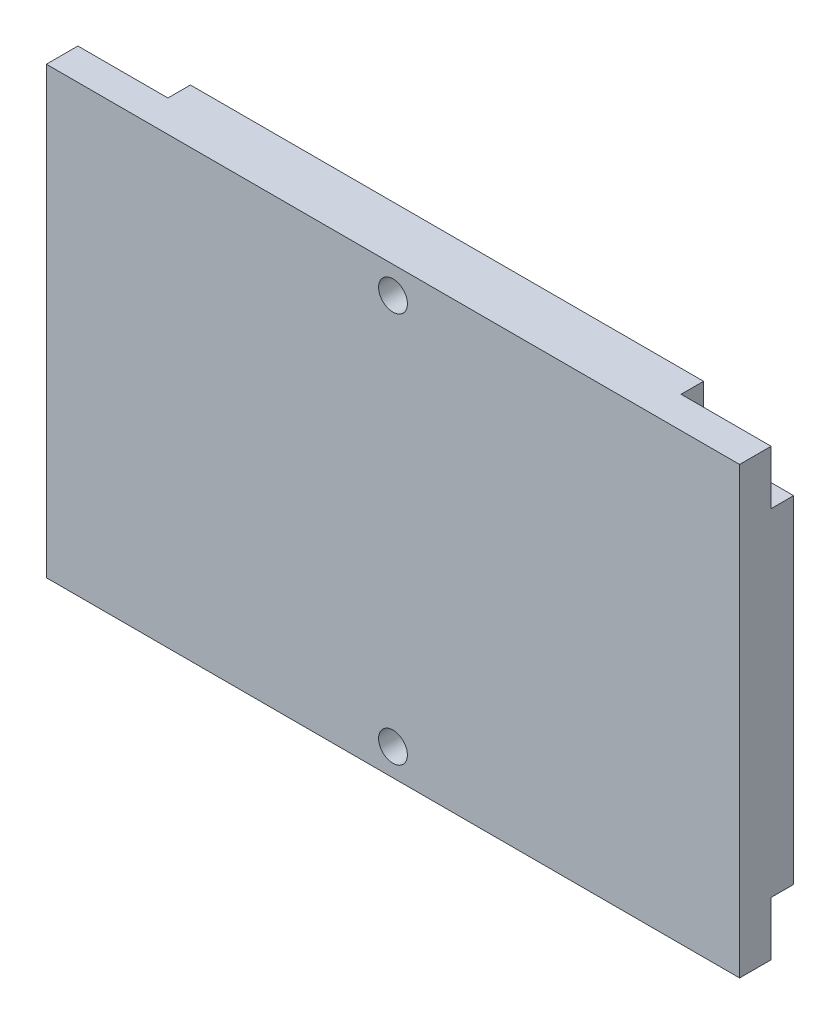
ISO-10303-21;
HEADER;
FILE_DESCRIPTION(('STEP AP214'),'2;1');
FILE_NAME('part.step','',(''),(''),'','','');
FILE_SCHEMA(('AUTOMOTIVE_DESIGN { 1 0 10303 214 1 1 1 1 }'));
ENDSEC;
DATA;
#1=APPLICATION_CONTEXT('core data for automotive mechanical design processes');
#2=APPLICATION_PROTOCOL_DEFINITION('international standard','automotive_design',2000,#1);
#3=PRODUCT_CONTEXT('',#1,'mechanical');
#4=PRODUCT('Part','Part','',(#3));
#5=PRODUCT_RELATED_PRODUCT_CATEGORY('part','',(#4));
#6=PRODUCT_DEFINITION_FORMATION('','',#4);
#7=PRODUCT_DEFINITION_CONTEXT('part definition',#1,'design');
#8=PRODUCT_DEFINITION('design','',#6,#7);
#9=PRODUCT_DEFINITION_SHAPE('','',#8);
#10=(LENGTH_UNIT() NAMED_UNIT(*) SI_UNIT(.MILLI.,.METRE.));
#11=(NAMED_UNIT(*) PLANE_ANGLE_UNIT() SI_UNIT($,.RADIAN.));
#12=(NAMED_UNIT(*) SI_UNIT($,.STERADIAN.) SOLID_ANGLE_UNIT());
#13=UNCERTAINTY_MEASURE_WITH_UNIT(LENGTH_MEASURE(1.E-05),#10,'distance_accuracy_value','');
#14=(GEOMETRIC_REPRESENTATION_CONTEXT(3) GLOBAL_UNCERTAINTY_ASSIGNED_CONTEXT((#13)) GLOBAL_UNIT_ASSIGNED_CONTEXT((#10,
#11,#12)) REPRESENTATION_CONTEXT('',''));
#15=CARTESIAN_POINT('',(0.,0.,0.));
#16=DIRECTION('',(0.,0.,1.));
#17=DIRECTION('',(1.,0.,0.));
#18=AXIS2_PLACEMENT_3D('',#15,#16,#17);
#19=CARTESIAN_POINT('',(38.5,18.7,6.00000000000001));
#20=DIRECTION('',(0.,-1.,0.));
#21=DIRECTION('',(1.,0.,0.));
#22=AXIS2_PLACEMENT_3D('',#19,#20,#21);
#23=PLANE('',#22);
#24=DIRECTION('',(-1.,0.,0.));
#25=VECTOR('',#24,1.);
#26=CARTESIAN_POINT('',(38.5,18.7,2.5));
#27=LINE('',#26,#25);
#28=CARTESIAN_POINT('',(38.5,18.7,2.5));
#29=VERTEX_POINT('',#28);
#30=CARTESIAN_POINT('',(30.7618950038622,18.7,2.5));
#31=VERTEX_POINT('',#30);
#32=EDGE_CURVE('E217',#29,#31,#27,.T.);
#33=ORIENTED_EDGE('',*,*,#32,.F.);
#34=DIRECTION('',(0.,0.,-1.));
#35=VECTOR('',#34,1.);
#36=CARTESIAN_POINT('',(38.5,18.7,6.00000000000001));
#37=LINE('',#36,#35);
#38=CARTESIAN_POINT('',(38.5,18.7,0.));
#39=VERTEX_POINT('',#38);
#40=EDGE_CURVE('E319',#29,#39,#37,.T.);
#41=ORIENTED_EDGE('',*,*,#40,.T.);
#42=DIRECTION('',(-1.,0.,0.));
#43=VECTOR('',#42,1.);
#44=CARTESIAN_POINT('',(38.5,18.7,0.));
#45=LINE('',#44,#43);
#46=CARTESIAN_POINT('',(30.7618950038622,18.7,0.));
#47=VERTEX_POINT('',#46);
#48=EDGE_CURVE('E294',#39,#47,#45,.T.);
#49=ORIENTED_EDGE('',*,*,#48,.T.);
#50=DIRECTION('',(0.,0.,-1.));
#51=VECTOR('',#50,1.);
#52=CARTESIAN_POINT('',(30.7618950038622,18.7,6.00000000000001));
#53=LINE('',#52,#51);
#54=EDGE_CURVE('E317',#31,#47,#53,.T.);
#55=ORIENTED_EDGE('',*,*,#54,.F.);
#56=EDGE_LOOP('',(#33,#41,#49,#55));
#57=FACE_BOUND('',#56,.T.);
#58=ADVANCED_FACE('F36',(#57),#23,.F.);
#59=CARTESIAN_POINT('',(29.6,19.8,6.00000000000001));
#60=DIRECTION('',(0.,0.,-1.));
#61=DIRECTION('',(-1.,0.,0.));
#62=AXIS2_PLACEMENT_3D('',#59,#60,#61);
#63=CYLINDRICAL_SURFACE('',#62,1.60000000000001);
#64=CARTESIAN_POINT('',(29.6,19.8,2.5));
#65=DIRECTION('',(0.,0.,1.));
#66=DIRECTION('',(1.,0.,0.));
#67=AXIS2_PLACEMENT_3D('',#64,#65,#66);
#68=CIRCLE('',#67,1.60000000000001);
#69=CARTESIAN_POINT('',(28.5,20.9618950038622,2.5));
#70=VERTEX_POINT('',#69);
#71=EDGE_CURVE('E215',#31,#70,#68,.F.);
#72=ORIENTED_EDGE('',*,*,#71,.F.);
#73=ORIENTED_EDGE('',*,*,#54,.T.);
#74=CARTESIAN_POINT('',(29.6,19.8,0.));
#75=DIRECTION('',(0.,0.,-1.));
#76=DIRECTION('',(-1.,0.,0.));
#77=AXIS2_PLACEMENT_3D('',#74,#75,#76);
#78=CIRCLE('',#77,1.60000000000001);
#79=CARTESIAN_POINT('',(28.5,20.9618950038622,0.));
#80=VERTEX_POINT('',#79);
#81=EDGE_CURVE('E297',#47,#80,#78,.T.);
#82=ORIENTED_EDGE('',*,*,#81,.T.);
#83=DIRECTION('',(0.,0.,-1.));
#84=VECTOR('',#83,1.);
#85=CARTESIAN_POINT('',(28.5,20.9618950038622,6.00000000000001));
#86=LINE('',#85,#84);
#87=EDGE_CURVE('E315',#70,#80,#86,.T.);
#88=ORIENTED_EDGE('',*,*,#87,.F.);
#89=EDGE_LOOP('',(#72,#73,#82,#88));
#90=FACE_BOUND('',#89,.T.);
#91=ADVANCED_FACE('F358',(#90),#63,.F.);
#92=CARTESIAN_POINT('',(28.5,24.7,6.00000000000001));
#93=DIRECTION('',(-1.,0.,0.));
#94=DIRECTION('',(0.,0.,1.));
#95=AXIS2_PLACEMENT_3D('',#92,#93,#94);
#96=PLANE('',#95);
#97=DIRECTION('',(0.,1.,0.));
#98=VECTOR('',#97,1.);
#99=CARTESIAN_POINT('',(28.5,24.7,2.5));
#100=LINE('',#99,#98);
#101=CARTESIAN_POINT('',(28.5,24.7,2.5));
#102=VERTEX_POINT('',#101);
#103=EDGE_CURVE('E213',#70,#102,#100,.T.);
#104=ORIENTED_EDGE('',*,*,#103,.F.);
#105=ORIENTED_EDGE('',*,*,#87,.T.);
#106=DIRECTION('',(0.,1.,0.));
#107=VECTOR('',#106,1.);
#108=CARTESIAN_POINT('',(28.5,24.7,0.));
#109=LINE('',#108,#107);
#110=CARTESIAN_POINT('',(28.5,24.7,0.));
#111=VERTEX_POINT('',#110);
#112=EDGE_CURVE('E300',#80,#111,#109,.T.);
#113=ORIENTED_EDGE('',*,*,#112,.T.);
#114=DIRECTION('',(0.,0.,-1.));
#115=VECTOR('',#114,1.);
#116=CARTESIAN_POINT('',(28.5,24.7,6.00000000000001));
#117=LINE('',#116,#115);
#118=EDGE_CURVE('E313',#102,#111,#117,.T.);
#119=ORIENTED_EDGE('',*,*,#118,.F.);
#120=EDGE_LOOP('',(#104,#105,#113,#119));
#121=FACE_BOUND('',#120,.T.);
#122=ADVANCED_FACE('F364',(#121),#96,.F.);
#123=CARTESIAN_POINT('',(-38.5,-18.7,6.00000000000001));
#124=DIRECTION('',(0.,1.,0.));
#125=DIRECTION('',(-1.,0.,0.));
#126=AXIS2_PLACEMENT_3D('',#123,#124,#125);
#127=PLANE('',#126);
#128=DIRECTION('',(1.,0.,0.));
#129=VECTOR('',#128,1.);
#130=CARTESIAN_POINT('',(-38.5,-18.7,2.5));
#131=LINE('',#130,#129);
#132=CARTESIAN_POINT('',(-38.5,-18.7,2.5));
#133=VERTEX_POINT('',#132);
#134=CARTESIAN_POINT('',(-30.7618950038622,-18.7,2.5));
#135=VERTEX_POINT('',#134);
#136=EDGE_CURVE('E231',#133,#135,#131,.T.);
#137=ORIENTED_EDGE('',*,*,#136,.F.);
#138=DIRECTION('',(0.,0.,-1.));
#139=VECTOR('',#138,1.);
#140=CARTESIAN_POINT('',(-38.5,-18.7,6.00000000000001));
#141=LINE('',#140,#139);
#142=CARTESIAN_POINT('',(-38.5,-18.7,0.));
#143=VERTEX_POINT('',#142);
#144=EDGE_CURVE('E334',#133,#143,#141,.T.);
#145=ORIENTED_EDGE('',*,*,#144,.T.);
#146=DIRECTION('',(1.,0.,0.));
#147=VECTOR('',#146,1.);
#148=CARTESIAN_POINT('',(-38.5,-18.7,0.));
#149=LINE('',#148,#147);
#150=CARTESIAN_POINT('',(-30.7618950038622,-18.7,0.));
#151=VERTEX_POINT('',#150);
#152=EDGE_CURVE('E271',#143,#151,#149,.T.);
#153=ORIENTED_EDGE('',*,*,#152,.T.);
#154=DIRECTION('',(0.,0.,-1.));
#155=VECTOR('',#154,1.);
#156=CARTESIAN_POINT('',(-30.7618950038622,-18.7,6.00000000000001));
#157=LINE('',#156,#155);
#158=EDGE_CURVE('E332',#135,#151,#157,.T.);
#159=ORIENTED_EDGE('',*,*,#158,.F.);
#160=EDGE_LOOP('',(#137,#145,#153,#159));
#161=FACE_BOUND('',#160,.T.);
#162=ADVANCED_FACE('F394',(#161),#127,.F.);
#163=CARTESIAN_POINT('',(-29.6,-19.8,6.00000000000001));
#164=DIRECTION('',(0.,0.,-1.));
#165=DIRECTION('',(-1.,0.,0.));
#166=AXIS2_PLACEMENT_3D('',#163,#164,#165);
#167=CYLINDRICAL_SURFACE('',#166,1.60000000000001);
#168=CARTESIAN_POINT('',(-29.6,-19.8,2.5));
#169=DIRECTION('',(0.,0.,1.));
#170=DIRECTION('',(1.,0.,0.));
#171=AXIS2_PLACEMENT_3D('',#168,#169,#170);
#172=CIRCLE('',#171,1.60000000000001);
#173=CARTESIAN_POINT('',(-28.5,-20.9618950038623,2.5));
#174=VERTEX_POINT('',#173);
#175=EDGE_CURVE('E229',#135,#174,#172,.F.);
#176=ORIENTED_EDGE('',*,*,#175,.F.);
#177=ORIENTED_EDGE('',*,*,#158,.T.);
#178=CARTESIAN_POINT('',(-29.6,-19.8,0.));
#179=DIRECTION('',(0.,0.,-1.));
#180=DIRECTION('',(-1.,0.,0.));
#181=AXIS2_PLACEMENT_3D('',#178,#179,#180);
#182=CIRCLE('',#181,1.60000000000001);
#183=CARTESIAN_POINT('',(-28.5,-20.9618950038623,0.));
#184=VERTEX_POINT('',#183);
#185=EDGE_CURVE('E274',#151,#184,#182,.T.);
#186=ORIENTED_EDGE('',*,*,#185,.T.);
#187=DIRECTION('',(0.,0.,-1.));
#188=VECTOR('',#187,1.);
#189=CARTESIAN_POINT('',(-28.5,-20.9618950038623,6.00000000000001));
#190=LINE('',#189,#188);
#191=EDGE_CURVE('E330',#174,#184,#190,.T.);
#192=ORIENTED_EDGE('',*,*,#191,.F.);
#193=EDGE_LOOP('',(#176,#177,#186,#192));
#194=FACE_BOUND('',#193,.T.);
#195=ADVANCED_FACE('F390',(#194),#167,.F.);
#196=CARTESIAN_POINT('',(-28.5,-20.9618950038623,6.00000000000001));
#197=DIRECTION('',(1.,0.,0.));
#198=DIRECTION('',(0.,0.,-1.));
#199=AXIS2_PLACEMENT_3D('',#196,#197,#198);
#200=PLANE('',#199);
#201=DIRECTION('',(0.,-1.,0.));
#202=VECTOR('',#201,1.);
#203=CARTESIAN_POINT('',(-28.5,-20.9618950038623,2.5));
#204=LINE('',#203,#202);
#205=CARTESIAN_POINT('',(-28.5,-24.7,2.5));
#206=VERTEX_POINT('',#205);
#207=EDGE_CURVE('E227',#174,#206,#204,.T.);
#208=ORIENTED_EDGE('',*,*,#207,.F.);
#209=ORIENTED_EDGE('',*,*,#191,.T.);
#210=DIRECTION('',(0.,-1.,0.));
#211=VECTOR('',#210,1.);
#212=CARTESIAN_POINT('',(-28.5,-20.9618950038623,0.));
#213=LINE('',#212,#211);
#214=CARTESIAN_POINT('',(-28.5,-24.7,0.));
#215=VERTEX_POINT('',#214);
#216=EDGE_CURVE('E277',#184,#215,#213,.T.);
#217=ORIENTED_EDGE('',*,*,#216,.T.);
#218=DIRECTION('',(0.,0.,-1.));
#219=VECTOR('',#218,1.);
#220=CARTESIAN_POINT('',(-28.5,-24.7,6.00000000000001));
#221=LINE('',#220,#219);
#222=EDGE_CURVE('E328',#206,#215,#221,.T.);
#223=ORIENTED_EDGE('',*,*,#222,.F.);
#224=EDGE_LOOP('',(#208,#209,#217,#223));
#225=FACE_BOUND('',#224,.T.);
#226=ADVANCED_FACE('F387',(#225),#200,.F.);
#227=CARTESIAN_POINT('',(-29.6,19.8,6.00000000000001));
#228=DIRECTION('',(0.,0.,1.));
#229=DIRECTION('',(1.,0.,0.));
#230=AXIS2_PLACEMENT_3D('',#227,#228,#229);
#231=PLANE('',#230);
#232=DIRECTION('',(1.,0.,0.));
#233=VECTOR('',#232,1.);
#234=CARTESIAN_POINT('',(-28.5,-24.7,6.00000000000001));
#235=LINE('',#234,#233);
#236=CARTESIAN_POINT('',(-38.5,-24.7,6.00000000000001));
#237=VERTEX_POINT('',#236);
#238=CARTESIAN_POINT('',(38.5,-24.7,6.00000000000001));
#239=VERTEX_POINT('',#238);
#240=EDGE_CURVE('E261',#237,#239,#235,.T.);
#241=ORIENTED_EDGE('',*,*,#240,.T.);
#242=DIRECTION('',(0.,1.,0.));
#243=VECTOR('',#242,1.);
#244=CARTESIAN_POINT('',(38.5,18.7,6.00000000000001));
#245=LINE('',#244,#243);
#246=CARTESIAN_POINT('',(38.5,24.7,6.00000000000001));
#247=VERTEX_POINT('',#246);
#248=EDGE_CURVE('E193',#239,#247,#245,.T.);
#249=ORIENTED_EDGE('',*,*,#248,.T.);
#250=DIRECTION('',(-1.,0.,0.));
#251=VECTOR('',#250,1.);
#252=CARTESIAN_POINT('',(-28.5,24.7,6.00000000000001));
#253=LINE('',#252,#251);
#254=CARTESIAN_POINT('',(-38.5,24.7,6.00000000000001));
#255=VERTEX_POINT('',#254);
#256=EDGE_CURVE('E265',#247,#255,#253,.T.);
#257=ORIENTED_EDGE('',*,*,#256,.T.);
#258=DIRECTION('',(0.,-1.,0.));
#259=VECTOR('',#258,1.);
#260=CARTESIAN_POINT('',(-38.5,18.7,6.00000000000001));
#261=LINE('',#260,#259);
#262=EDGE_CURVE('E259',#255,#237,#261,.T.);
#263=ORIENTED_EDGE('',*,*,#262,.T.);
#264=EDGE_LOOP('',(#241,#249,#257,#263));
#265=FACE_BOUND('',#264,.T.);
#266=CARTESIAN_POINT('',(0.,21.7,6.00000000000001));
#267=DIRECTION('',(0.,0.,1.));
#268=DIRECTION('',(1.,0.,0.));
#269=AXIS2_PLACEMENT_3D('',#266,#267,#268);
#270=CIRCLE('',#269,1.6);
#271=CARTESIAN_POINT('',(1.6,21.7,6.00000000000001));
#272=VERTEX_POINT('',#271);
#273=EDGE_CURVE('E253',#272,#272,#270,.T.);
#274=ORIENTED_EDGE('',*,*,#273,.F.);
#275=EDGE_LOOP('',(#274));
#276=FACE_BOUND('',#275,.T.);
#277=CARTESIAN_POINT('',(0.,-21.7,6.00000000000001));
#278=DIRECTION('',(0.,0.,1.));
#279=DIRECTION('',(-1.,0.,0.));
#280=AXIS2_PLACEMENT_3D('',#277,#278,#279);
#281=CIRCLE('',#280,1.6);
#282=CARTESIAN_POINT('',(-1.6,-21.7,6.00000000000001));
#283=VERTEX_POINT('',#282);
#284=EDGE_CURVE('E247',#283,#283,#281,.T.);
#285=ORIENTED_EDGE('',*,*,#284,.F.);
#286=EDGE_LOOP('',(#285));
#287=FACE_BOUND('',#286,.T.);
#288=ADVANCED_FACE('F354',(#265,#276,#287),#231,.T.);
#289=CARTESIAN_POINT('',(-29.6,19.8,0.));
#290=DIRECTION('',(0.,0.,1.));
#291=DIRECTION('',(1.,0.,0.));
#292=AXIS2_PLACEMENT_3D('',#289,#290,#291);
#293=PLANE('',#292);
#294=CARTESIAN_POINT('',(0.,21.7,0.));
#295=DIRECTION('',(0.,0.,1.));
#296=DIRECTION('',(1.,0.,0.));
#297=AXIS2_PLACEMENT_3D('',#294,#295,#296);
#298=CIRCLE('',#297,1.6);
#299=CARTESIAN_POINT('',(1.6,21.7,0.));
#300=VERTEX_POINT('',#299);
#301=EDGE_CURVE('E250',#300,#300,#298,.T.);
#302=ORIENTED_EDGE('',*,*,#301,.T.);
#303=EDGE_LOOP('',(#302));
#304=FACE_BOUND('',#303,.T.);
#305=DIRECTION('',(-1.,0.,0.));
#306=VECTOR('',#305,1.);
#307=CARTESIAN_POINT('',(-38.5,18.7,0.));
#308=LINE('',#307,#306);
#309=CARTESIAN_POINT('',(-30.7618950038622,18.7,0.));
#310=VERTEX_POINT('',#309);
#311=CARTESIAN_POINT('',(-38.5,18.7,0.));
#312=VERTEX_POINT('',#311);
#313=EDGE_CURVE('E256',#310,#312,#308,.T.);
#314=ORIENTED_EDGE('',*,*,#313,.F.);
#315=CARTESIAN_POINT('',(-29.6,19.8,0.));
#316=DIRECTION('',(0.,0.,-1.));
#317=DIRECTION('',(1.,0.,0.));
#318=AXIS2_PLACEMENT_3D('',#315,#316,#317);
#319=CIRCLE('',#318,1.60000000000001);
#320=CARTESIAN_POINT('',(-28.5,20.9618950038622,0.));
#321=VERTEX_POINT('',#320);
#322=EDGE_CURVE('E262',#321,#310,#319,.T.);
#323=ORIENTED_EDGE('',*,*,#322,.F.);
#324=DIRECTION('',(0.,-1.,0.));
#325=VECTOR('',#324,1.);
#326=CARTESIAN_POINT('',(-28.5,20.9618950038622,0.));
#327=LINE('',#326,#325);
#328=CARTESIAN_POINT('',(-28.5,24.7,0.));
#329=VERTEX_POINT('',#328);
#330=EDGE_CURVE('E306',#329,#321,#327,.T.);
#331=ORIENTED_EDGE('',*,*,#330,.F.);
#332=DIRECTION('',(-1.,0.,0.));
#333=VECTOR('',#332,1.);
#334=CARTESIAN_POINT('',(-28.5,24.7,0.));
#335=LINE('',#334,#333);
#336=EDGE_CURVE('E303',#111,#329,#335,.T.);
#337=ORIENTED_EDGE('',*,*,#336,.F.);
#338=ORIENTED_EDGE('',*,*,#112,.F.);
#339=ORIENTED_EDGE('',*,*,#81,.F.);
#340=ORIENTED_EDGE('',*,*,#48,.F.);
#341=DIRECTION('',(0.,1.,0.));
#342=VECTOR('',#341,1.);
#343=CARTESIAN_POINT('',(38.5,18.7,0.));
#344=LINE('',#343,#342);
#345=CARTESIAN_POINT('',(38.5,-18.7,0.));
#346=VERTEX_POINT('',#345);
#347=EDGE_CURVE('E291',#346,#39,#344,.T.);
#348=ORIENTED_EDGE('',*,*,#347,.F.);
#349=DIRECTION('',(1.,0.,0.));
#350=VECTOR('',#349,1.);
#351=CARTESIAN_POINT('',(38.5,-18.7,0.));
#352=LINE('',#351,#350);
#353=CARTESIAN_POINT('',(30.7618950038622,-18.7,0.));
#354=VERTEX_POINT('',#353);
#355=EDGE_CURVE('E288',#354,#346,#352,.T.);
#356=ORIENTED_EDGE('',*,*,#355,.F.);
#357=CARTESIAN_POINT('',(29.6,-19.8,0.));
#358=DIRECTION('',(0.,0.,-1.));
#359=DIRECTION('',(1.,0.,0.));
#360=AXIS2_PLACEMENT_3D('',#357,#358,#359);
#361=CIRCLE('',#360,1.60000000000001);
#362=CARTESIAN_POINT('',(28.5,-20.9618950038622,0.));
#363=VERTEX_POINT('',#362);
#364=EDGE_CURVE('E285',#363,#354,#361,.T.);
#365=ORIENTED_EDGE('',*,*,#364,.F.);
#366=DIRECTION('',(0.,1.,0.));
#367=VECTOR('',#366,1.);
#368=CARTESIAN_POINT('',(28.5,-20.9618950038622,0.));
#369=LINE('',#368,#367);
#370=CARTESIAN_POINT('',(28.5,-24.7,0.));
#371=VERTEX_POINT('',#370);
#372=EDGE_CURVE('E282',#371,#363,#369,.T.);
#373=ORIENTED_EDGE('',*,*,#372,.F.);
#374=DIRECTION('',(1.,0.,0.));
#375=VECTOR('',#374,1.);
#376=CARTESIAN_POINT('',(-28.5,-24.7,0.));
#377=LINE('',#376,#375);
#378=EDGE_CURVE('E280',#215,#371,#377,.T.);
#379=ORIENTED_EDGE('',*,*,#378,.F.);
#380=ORIENTED_EDGE('',*,*,#216,.F.);
#381=ORIENTED_EDGE('',*,*,#185,.F.);
#382=ORIENTED_EDGE('',*,*,#152,.F.);
#383=DIRECTION('',(0.,-1.,0.));
#384=VECTOR('',#383,1.);
#385=CARTESIAN_POINT('',(-38.5,18.7,0.));
#386=LINE('',#385,#384);
#387=EDGE_CURVE('E268',#312,#143,#386,.T.);
#388=ORIENTED_EDGE('',*,*,#387,.F.);
#389=EDGE_LOOP('',(#314,#323,#331,#337,#338,#339,#340,#348,#356,#365,#373,#379,#380,#381,#382,#388));
#390=FACE_BOUND('',#389,.T.);
#391=CARTESIAN_POINT('',(0.,-21.7,0.));
#392=DIRECTION('',(0.,0.,1.));
#393=DIRECTION('',(-1.,0.,0.));
#394=AXIS2_PLACEMENT_3D('',#391,#392,#393);
#395=CIRCLE('',#394,1.6);
#396=CARTESIAN_POINT('',(-1.6,-21.7,0.));
#397=VERTEX_POINT('',#396);
#398=EDGE_CURVE('E246',#397,#397,#395,.T.);
#399=ORIENTED_EDGE('',*,*,#398,.T.);
#400=EDGE_LOOP('',(#399));
#401=FACE_BOUND('',#400,.T.);
#402=ADVANCED_FACE('F345',(#304,#390,#401),#293,.F.);
#403=CARTESIAN_POINT('',(-38.5,18.7,6.00000000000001));
#404=DIRECTION('',(0.,-1.,0.));
#405=DIRECTION('',(1.,0.,0.));
#406=AXIS2_PLACEMENT_3D('',#403,#404,#405);
#407=PLANE('',#406);
#408=DIRECTION('',(0.,0.,-1.));
#409=VECTOR('',#408,1.);
#410=CARTESIAN_POINT('',(-38.5,18.7,6.00000000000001));
#411=LINE('',#410,#409);
#412=CARTESIAN_POINT('',(-38.5,18.7,2.5));
#413=VERTEX_POINT('',#412);
#414=EDGE_CURVE('E44',#413,#312,#411,.T.);
#415=ORIENTED_EDGE('',*,*,#414,.F.);
#416=DIRECTION('',(1.,0.,0.));
#417=VECTOR('',#416,1.);
#418=CARTESIAN_POINT('',(-38.5,18.7,2.5));
#419=LINE('',#418,#417);
#420=CARTESIAN_POINT('',(-30.7618950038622,18.7,2.5));
#421=VERTEX_POINT('',#420);
#422=EDGE_CURVE('E244',#413,#421,#419,.T.);
#423=ORIENTED_EDGE('',*,*,#422,.T.);
#424=DIRECTION('',(0.,0.,-1.));
#425=VECTOR('',#424,1.);
#426=CARTESIAN_POINT('',(-30.7618950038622,18.7,6.00000000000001));
#427=LINE('',#426,#425);
#428=EDGE_CURVE('E51',#421,#310,#427,.T.);
#429=ORIENTED_EDGE('',*,*,#428,.T.);
#430=ORIENTED_EDGE('',*,*,#313,.T.);
#431=EDGE_LOOP('',(#415,#423,#429,#430));
#432=FACE_BOUND('',#431,.T.);
#433=ADVANCED_FACE('F38',(#432),#407,.F.);
#434=CARTESIAN_POINT('',(-38.5,18.7,6.00000000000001));
#435=DIRECTION('',(1.,0.,0.));
#436=DIRECTION('',(0.,1.,0.));
#437=AXIS2_PLACEMENT_3D('',#434,#435,#436);
#438=PLANE('',#437);
#439=DIRECTION('',(0.,0.,1.));
#440=VECTOR('',#439,1.);
#441=CARTESIAN_POINT('',(-38.5,-24.7,2.5));
#442=LINE('',#441,#440);
#443=CARTESIAN_POINT('',(-38.5,-24.7,2.5));
#444=VERTEX_POINT('',#443);
#445=EDGE_CURVE('E224',#444,#237,#442,.T.);
#446=ORIENTED_EDGE('',*,*,#445,.T.);
#447=ORIENTED_EDGE('',*,*,#262,.F.);
#448=DIRECTION('',(0.,0.,1.));
#449=VECTOR('',#448,1.);
#450=CARTESIAN_POINT('',(-38.5,24.7,2.5));
#451=LINE('',#450,#449);
#452=CARTESIAN_POINT('',(-38.5,24.7,2.5));
#453=VERTEX_POINT('',#452);
#454=EDGE_CURVE('E238',#453,#255,#451,.T.);
#455=ORIENTED_EDGE('',*,*,#454,.F.);
#456=DIRECTION('',(0.,-1.,0.));
#457=VECTOR('',#456,1.);
#458=CARTESIAN_POINT('',(-38.5,24.7,2.5));
#459=LINE('',#458,#457);
#460=EDGE_CURVE('E235',#453,#413,#459,.T.);
#461=ORIENTED_EDGE('',*,*,#460,.T.);
#462=ORIENTED_EDGE('',*,*,#414,.T.);
#463=ORIENTED_EDGE('',*,*,#387,.T.);
#464=ORIENTED_EDGE('',*,*,#144,.F.);
#465=DIRECTION('',(0.,-1.,0.));
#466=VECTOR('',#465,1.);
#467=CARTESIAN_POINT('',(-38.5,-13.6713499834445,2.5));
#468=LINE('',#467,#466);
#469=EDGE_CURVE('E219',#133,#444,#468,.T.);
#470=ORIENTED_EDGE('',*,*,#469,.T.);
#471=EDGE_LOOP('',(#446,#447,#455,#461,#462,#463,#464,#470));
#472=FACE_BOUND('',#471,.T.);
#473=ADVANCED_FACE('F338',(#472),#438,.F.);
#474=CARTESIAN_POINT('',(-28.5,-24.7,6.00000000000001));
#475=DIRECTION('',(0.,1.,0.));
#476=DIRECTION('',(-1.,0.,0.));
#477=AXIS2_PLACEMENT_3D('',#474,#475,#476);
#478=PLANE('',#477);
#479=DIRECTION('',(0.,0.,1.));
#480=VECTOR('',#479,1.);
#481=CARTESIAN_POINT('',(38.5,-24.7,2.5));
#482=LINE('',#481,#480);
#483=CARTESIAN_POINT('',(38.5,-24.7,2.5));
#484=VERTEX_POINT('',#483);
#485=EDGE_CURVE('E179',#484,#239,#482,.T.);
#486=ORIENTED_EDGE('',*,*,#485,.T.);
#487=ORIENTED_EDGE('',*,*,#240,.F.);
#488=ORIENTED_EDGE('',*,*,#445,.F.);
#489=DIRECTION('',(1.,0.,0.));
#490=VECTOR('',#489,1.);
#491=CARTESIAN_POINT('',(-38.5,-24.7,2.5));
#492=LINE('',#491,#490);
#493=EDGE_CURVE('E221',#444,#206,#492,.T.);
#494=ORIENTED_EDGE('',*,*,#493,.T.);
#495=ORIENTED_EDGE('',*,*,#222,.T.);
#496=ORIENTED_EDGE('',*,*,#378,.T.);
#497=DIRECTION('',(0.,0.,-1.));
#498=VECTOR('',#497,1.);
#499=CARTESIAN_POINT('',(28.5,-24.7,6.00000000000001));
#500=LINE('',#499,#498);
#501=CARTESIAN_POINT('',(28.5,-24.7,2.5));
#502=VERTEX_POINT('',#501);
#503=EDGE_CURVE('E181',#502,#371,#500,.T.);
#504=ORIENTED_EDGE('',*,*,#503,.F.);
#505=DIRECTION('',(1.,0.,0.));
#506=VECTOR('',#505,1.);
#507=CARTESIAN_POINT('',(38.5,-24.7,2.5));
#508=LINE('',#507,#506);
#509=EDGE_CURVE('E175',#502,#484,#508,.T.);
#510=ORIENTED_EDGE('',*,*,#509,.T.);
#511=EDGE_LOOP('',(#486,#487,#488,#494,#495,#496,#504,#510));
#512=FACE_BOUND('',#511,.T.);
#513=ADVANCED_FACE('F177',(#512),#478,.F.);
#514=CARTESIAN_POINT('',(28.5,-20.9618950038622,6.00000000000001));
#515=DIRECTION('',(-1.,0.,0.));
#516=DIRECTION('',(0.,0.,1.));
#517=AXIS2_PLACEMENT_3D('',#514,#515,#516);
#518=PLANE('',#517);
#519=DIRECTION('',(0.,0.,-1.));
#520=VECTOR('',#519,1.);
#521=CARTESIAN_POINT('',(28.5,-20.9618950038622,6.00000000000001));
#522=LINE('',#521,#520);
#523=CARTESIAN_POINT('',(28.5,-20.9618950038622,2.5));
#524=VERTEX_POINT('',#523);
#525=EDGE_CURVE('E325',#524,#363,#522,.T.);
#526=ORIENTED_EDGE('',*,*,#525,.F.);
#527=DIRECTION('',(0.,-1.,0.));
#528=VECTOR('',#527,1.);
#529=CARTESIAN_POINT('',(28.5,-20.9618950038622,2.5));
#530=LINE('',#529,#528);
#531=EDGE_CURVE('E204',#524,#502,#530,.T.);
#532=ORIENTED_EDGE('',*,*,#531,.T.);
#533=ORIENTED_EDGE('',*,*,#503,.T.);
#534=ORIENTED_EDGE('',*,*,#372,.T.);
#535=EDGE_LOOP('',(#526,#532,#533,#534));
#536=FACE_BOUND('',#535,.T.);
#537=ADVANCED_FACE('F380',(#536),#518,.F.);
#538=CARTESIAN_POINT('',(29.6,-19.8,6.00000000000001));
#539=DIRECTION('',(0.,0.,-1.));
#540=DIRECTION('',(-1.,0.,0.));
#541=AXIS2_PLACEMENT_3D('',#538,#539,#540);
#542=CYLINDRICAL_SURFACE('',#541,1.60000000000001);
#543=DIRECTION('',(0.,0.,-1.));
#544=VECTOR('',#543,1.);
#545=CARTESIAN_POINT('',(30.7618950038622,-18.7,6.00000000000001));
#546=LINE('',#545,#544);
#547=CARTESIAN_POINT('',(30.7618950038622,-18.7,2.5));
#548=VERTEX_POINT('',#547);
#549=EDGE_CURVE('E323',#548,#354,#546,.T.);
#550=ORIENTED_EDGE('',*,*,#549,.F.);
#551=CARTESIAN_POINT('',(29.6,-19.8,2.5));
#552=DIRECTION('',(0.,0.,-1.));
#553=DIRECTION('',(-1.,0.,0.));
#554=AXIS2_PLACEMENT_3D('',#551,#552,#553);
#555=CIRCLE('',#554,1.60000000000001);
#556=EDGE_CURVE('E201',#548,#524,#555,.F.);
#557=ORIENTED_EDGE('',*,*,#556,.T.);
#558=ORIENTED_EDGE('',*,*,#525,.T.);
#559=ORIENTED_EDGE('',*,*,#364,.T.);
#560=EDGE_LOOP('',(#550,#557,#558,#559));
#561=FACE_BOUND('',#560,.T.);
#562=ADVANCED_FACE('F376',(#561),#542,.F.);
#563=CARTESIAN_POINT('',(38.5,-18.7,6.00000000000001));
#564=DIRECTION('',(0.,1.,0.));
#565=DIRECTION('',(-1.,0.,0.));
#566=AXIS2_PLACEMENT_3D('',#563,#564,#565);
#567=PLANE('',#566);
#568=DIRECTION('',(0.,0.,-1.));
#569=VECTOR('',#568,1.);
#570=CARTESIAN_POINT('',(38.5,-18.7,6.00000000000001));
#571=LINE('',#570,#569);
#572=CARTESIAN_POINT('',(38.5,-18.7,2.5));
#573=VERTEX_POINT('',#572);
#574=EDGE_CURVE('E321',#573,#346,#571,.T.);
#575=ORIENTED_EDGE('',*,*,#574,.F.);
#576=DIRECTION('',(-1.,0.,0.));
#577=VECTOR('',#576,1.);
#578=CARTESIAN_POINT('',(38.5,-18.7,2.5));
#579=LINE('',#578,#577);
#580=EDGE_CURVE('E194',#573,#548,#579,.T.);
#581=ORIENTED_EDGE('',*,*,#580,.T.);
#582=ORIENTED_EDGE('',*,*,#549,.T.);
#583=ORIENTED_EDGE('',*,*,#355,.T.);
#584=EDGE_LOOP('',(#575,#581,#582,#583));
#585=FACE_BOUND('',#584,.T.);
#586=ADVANCED_FACE('F373',(#585),#567,.F.);
#587=CARTESIAN_POINT('',(38.5,18.7,6.00000000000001));
#588=DIRECTION('',(-1.,0.,0.));
#589=DIRECTION('',(0.,0.,1.));
#590=AXIS2_PLACEMENT_3D('',#587,#588,#589);
#591=PLANE('',#590);
#592=DIRECTION('',(0.,0.,1.));
#593=VECTOR('',#592,1.);
#594=CARTESIAN_POINT('',(38.5,24.7,2.5));
#595=LINE('',#594,#593);
#596=CARTESIAN_POINT('',(38.5,24.7,2.5));
#597=VERTEX_POINT('',#596);
#598=EDGE_CURVE('E211',#597,#247,#595,.T.);
#599=ORIENTED_EDGE('',*,*,#598,.T.);
#600=ORIENTED_EDGE('',*,*,#248,.F.);
#601=ORIENTED_EDGE('',*,*,#485,.F.);
#602=DIRECTION('',(0.,1.,0.));
#603=VECTOR('',#602,1.);
#604=CARTESIAN_POINT('',(38.5,-8.96910221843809,2.5));
#605=LINE('',#604,#603);
#606=EDGE_CURVE('E185',#484,#573,#605,.T.);
#607=ORIENTED_EDGE('',*,*,#606,.T.);
#608=ORIENTED_EDGE('',*,*,#574,.T.);
#609=ORIENTED_EDGE('',*,*,#347,.T.);
#610=ORIENTED_EDGE('',*,*,#40,.F.);
#611=DIRECTION('',(0.,1.,0.));
#612=VECTOR('',#611,1.);
#613=CARTESIAN_POINT('',(38.5,24.7,2.5));
#614=LINE('',#613,#612);
#615=EDGE_CURVE('E206',#29,#597,#614,.T.);
#616=ORIENTED_EDGE('',*,*,#615,.T.);
#617=EDGE_LOOP('',(#599,#600,#601,#607,#608,#609,#610,#616));
#618=FACE_BOUND('',#617,.T.);
#619=ADVANCED_FACE('F191',(#618),#591,.F.);
#620=CARTESIAN_POINT('',(-28.5,24.7,6.00000000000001));
#621=DIRECTION('',(0.,-1.,0.));
#622=DIRECTION('',(1.,0.,0.));
#623=AXIS2_PLACEMENT_3D('',#620,#621,#622);
#624=PLANE('',#623);
#625=ORIENTED_EDGE('',*,*,#454,.T.);
#626=ORIENTED_EDGE('',*,*,#256,.F.);
#627=ORIENTED_EDGE('',*,*,#598,.F.);
#628=DIRECTION('',(-1.,0.,0.));
#629=VECTOR('',#628,1.);
#630=CARTESIAN_POINT('',(22.0744408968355,24.7,2.5));
#631=LINE('',#630,#629);
#632=EDGE_CURVE('E208',#597,#102,#631,.T.);
#633=ORIENTED_EDGE('',*,*,#632,.T.);
#634=ORIENTED_EDGE('',*,*,#118,.T.);
#635=ORIENTED_EDGE('',*,*,#336,.T.);
#636=DIRECTION('',(0.,0.,-1.));
#637=VECTOR('',#636,1.);
#638=CARTESIAN_POINT('',(-28.5,24.7,6.00000000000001));
#639=LINE('',#638,#637);
#640=CARTESIAN_POINT('',(-28.5,24.7,2.5));
#641=VERTEX_POINT('',#640);
#642=EDGE_CURVE('E311',#641,#329,#639,.T.);
#643=ORIENTED_EDGE('',*,*,#642,.F.);
#644=DIRECTION('',(-1.,0.,0.));
#645=VECTOR('',#644,1.);
#646=CARTESIAN_POINT('',(-25.2092727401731,24.7,2.5));
#647=LINE('',#646,#645);
#648=EDGE_CURVE('E233',#641,#453,#647,.T.);
#649=ORIENTED_EDGE('',*,*,#648,.T.);
#650=EDGE_LOOP('',(#625,#626,#627,#633,#634,#635,#643,#649));
#651=FACE_BOUND('',#650,.T.);
#652=ADVANCED_FACE('F372',(#651),#624,.F.);
#653=CARTESIAN_POINT('',(-28.5,20.9618950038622,6.00000000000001));
#654=DIRECTION('',(1.,0.,0.));
#655=DIRECTION('',(0.,0.,-1.));
#656=AXIS2_PLACEMENT_3D('',#653,#654,#655);
#657=PLANE('',#656);
#658=DIRECTION('',(0.,0.,-1.));
#659=VECTOR('',#658,1.);
#660=CARTESIAN_POINT('',(-28.5,20.9618950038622,6.00000000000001));
#661=LINE('',#660,#659);
#662=CARTESIAN_POINT('',(-28.5,20.9618950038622,2.5));
#663=VERTEX_POINT('',#662);
#664=EDGE_CURVE('E57',#663,#321,#661,.T.);
#665=ORIENTED_EDGE('',*,*,#664,.F.);
#666=DIRECTION('',(0.,1.,0.));
#667=VECTOR('',#666,1.);
#668=CARTESIAN_POINT('',(-28.5,20.9618950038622,2.5));
#669=LINE('',#668,#667);
#670=EDGE_CURVE('E241',#663,#641,#669,.T.);
#671=ORIENTED_EDGE('',*,*,#670,.T.);
#672=ORIENTED_EDGE('',*,*,#642,.T.);
#673=ORIENTED_EDGE('',*,*,#330,.T.);
#674=EDGE_LOOP('',(#665,#671,#672,#673));
#675=FACE_BOUND('',#674,.T.);
#676=ADVANCED_FACE('F444',(#675),#657,.F.);
#677=CARTESIAN_POINT('',(-29.6,19.8,6.00000000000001));
#678=DIRECTION('',(0.,0.,-1.));
#679=DIRECTION('',(-1.,0.,0.));
#680=AXIS2_PLACEMENT_3D('',#677,#678,#679);
#681=CYLINDRICAL_SURFACE('',#680,1.60000000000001);
#682=ORIENTED_EDGE('',*,*,#428,.F.);
#683=CARTESIAN_POINT('',(-29.6,19.8,2.5));
#684=DIRECTION('',(0.,0.,-1.));
#685=DIRECTION('',(-1.,0.,0.));
#686=AXIS2_PLACEMENT_3D('',#683,#684,#685);
#687=CIRCLE('',#686,1.60000000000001);
#688=EDGE_CURVE('E11',#421,#663,#687,.F.);
#689=ORIENTED_EDGE('',*,*,#688,.T.);
#690=ORIENTED_EDGE('',*,*,#664,.T.);
#691=ORIENTED_EDGE('',*,*,#322,.T.);
#692=EDGE_LOOP('',(#682,#689,#690,#691));
#693=FACE_BOUND('',#692,.T.);
#694=ADVANCED_FACE('F441',(#693),#681,.F.);
#695=CARTESIAN_POINT('',(0.,21.7,6.00000000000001));
#696=DIRECTION('',(0.,0.,-1.));
#697=DIRECTION('',(-1.,0.,0.));
#698=AXIS2_PLACEMENT_3D('',#695,#696,#697);
#699=CYLINDRICAL_SURFACE('',#698,1.6);
#700=ORIENTED_EDGE('',*,*,#273,.T.);
#701=EDGE_LOOP('',(#700));
#702=FACE_BOUND('',#701,.T.);
#703=ORIENTED_EDGE('',*,*,#301,.F.);
#704=EDGE_LOOP('',(#703));
#705=FACE_BOUND('',#704,.T.);
#706=ADVANCED_FACE('F452',(#702,#705),#699,.F.);
#707=CARTESIAN_POINT('',(0.,-21.7,6.00000000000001));
#708=DIRECTION('',(0.,0.,-1.));
#709=DIRECTION('',(-1.,0.,0.));
#710=AXIS2_PLACEMENT_3D('',#707,#708,#709);
#711=CYLINDRICAL_SURFACE('',#710,1.6);
#712=ORIENTED_EDGE('',*,*,#284,.T.);
#713=EDGE_LOOP('',(#712));
#714=FACE_BOUND('',#713,.T.);
#715=ORIENTED_EDGE('',*,*,#398,.F.);
#716=EDGE_LOOP('',(#715));
#717=FACE_BOUND('',#716,.T.);
#718=ADVANCED_FACE('F460',(#714,#717),#711,.F.);
#719=CARTESIAN_POINT('',(0.,0.,2.5));
#720=DIRECTION('',(0.,0.,-1.));
#721=DIRECTION('',(-1.,0.,0.));
#722=AXIS2_PLACEMENT_3D('',#719,#720,#721);
#723=PLANE('',#722);
#724=ORIENTED_EDGE('',*,*,#422,.F.);
#725=ORIENTED_EDGE('',*,*,#460,.F.);
#726=ORIENTED_EDGE('',*,*,#648,.F.);
#727=ORIENTED_EDGE('',*,*,#670,.F.);
#728=ORIENTED_EDGE('',*,*,#688,.F.);
#729=EDGE_LOOP('',(#724,#725,#726,#727,#728));
#730=FACE_BOUND('',#729,.T.);
#731=ADVANCED_FACE('F440',(#730),#723,.T.);
#732=CARTESIAN_POINT('',(0.,0.,2.5));
#733=DIRECTION('',(0.,0.,1.));
#734=DIRECTION('',(1.,0.,0.));
#735=AXIS2_PLACEMENT_3D('',#732,#733,#734);
#736=PLANE('',#735);
#737=ORIENTED_EDGE('',*,*,#469,.F.);
#738=ORIENTED_EDGE('',*,*,#136,.T.);
#739=ORIENTED_EDGE('',*,*,#175,.T.);
#740=ORIENTED_EDGE('',*,*,#207,.T.);
#741=ORIENTED_EDGE('',*,*,#493,.F.);
#742=EDGE_LOOP('',(#737,#738,#739,#740,#741));
#743=FACE_BOUND('',#742,.T.);
#744=ADVANCED_FACE('F410',(#743),#736,.F.);
#745=CARTESIAN_POINT('',(0.,0.,2.5));
#746=DIRECTION('',(0.,0.,1.));
#747=DIRECTION('',(1.,0.,0.));
#748=AXIS2_PLACEMENT_3D('',#745,#746,#747);
#749=PLANE('',#748);
#750=ORIENTED_EDGE('',*,*,#615,.F.);
#751=ORIENTED_EDGE('',*,*,#32,.T.);
#752=ORIENTED_EDGE('',*,*,#71,.T.);
#753=ORIENTED_EDGE('',*,*,#103,.T.);
#754=ORIENTED_EDGE('',*,*,#632,.F.);
#755=EDGE_LOOP('',(#750,#751,#752,#753,#754));
#756=FACE_BOUND('',#755,.T.);
#757=ADVANCED_FACE('F428',(#756),#749,.F.);
#758=CARTESIAN_POINT('',(0.,0.,2.5));
#759=DIRECTION('',(0.,0.,-1.));
#760=DIRECTION('',(-1.,0.,0.));
#761=AXIS2_PLACEMENT_3D('',#758,#759,#760);
#762=PLANE('',#761);
#763=ORIENTED_EDGE('',*,*,#531,.F.);
#764=ORIENTED_EDGE('',*,*,#556,.F.);
#765=ORIENTED_EDGE('',*,*,#580,.F.);
#766=ORIENTED_EDGE('',*,*,#606,.F.);
#767=ORIENTED_EDGE('',*,*,#509,.F.);
#768=EDGE_LOOP('',(#763,#764,#765,#766,#767));
#769=FACE_BOUND('',#768,.T.);
#770=ADVANCED_FACE('F196',(#769),#762,.T.);
#771=CLOSED_SHELL('',(#58,#91,#122,#162,#195,#226,#288,#402,#433,#473,#513,#537,#562,#586,#619,
#652,#676,#694,#706,#718,#731,#744,#757,#770));
#772=MANIFOLD_SOLID_BREP('B2',#771);
#773=ADVANCED_BREP_SHAPE_REPRESENTATION('',(#18,#772),#14);
#774=SHAPE_DEFINITION_REPRESENTATION(#9,#773);
ENDSEC;
END-ISO-10303-21;
